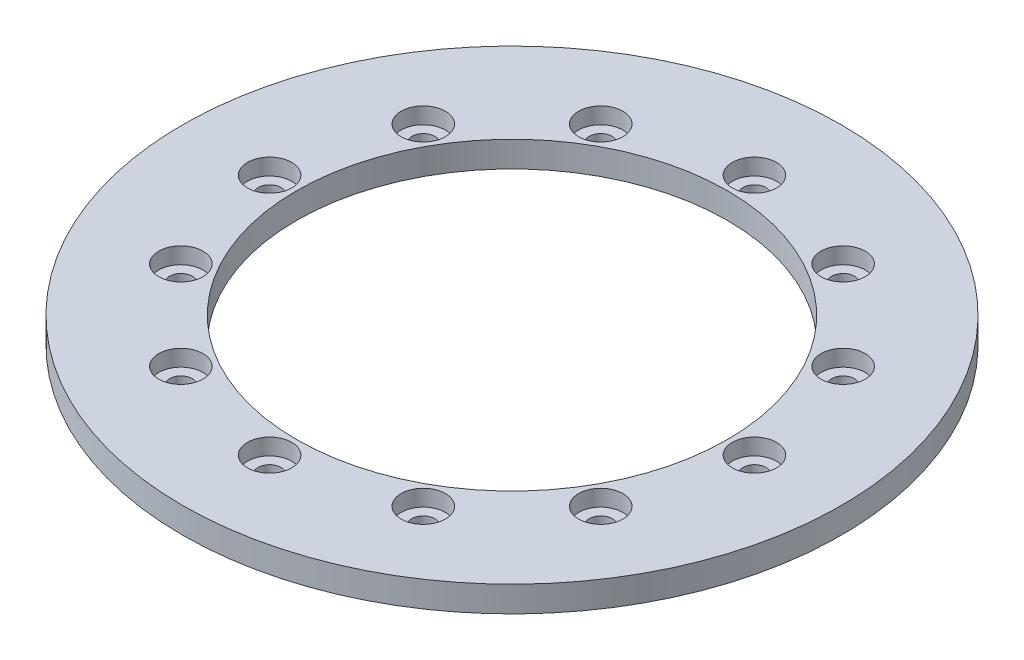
from build123d import *

# Parameters (mm, degrees)
SKETCH1_R                                      = 65
SKETCH1_R_2                                    = 42.5
BOSS_EXTRUDE1_DEPTH                            = 5.08
CBORE_FOR_8_BUTTON_HEAD_CAP_SCREW1_D           = 4.4958
CBORE_FOR_8_BUTTON_HEAD_CAP_SCREW1_CBORE_D     = 8.73252
CBORE_FOR_8_BUTTON_HEAD_CAP_SCREW1_CBORE_DEPTH = 3.2258
CIRPATTERN1_COUNT                              = 12


with BuildPart() as part:
    # Sketch1 → Boss-Extrude1 (new body)
    with BuildSketch(Plane(origin=(0, 0, 0), x_dir=(1, 0, 0), z_dir=(0, 1, 0))):
        with Locations(Location((0, 0, 0), (0, 0, 270))):
            Circle(SKETCH1_R)
        with Locations(Location((0, 0, 0), (0, 0, 270))):
            Circle(SKETCH1_R_2, mode=Mode.SUBTRACT)
    extrude(amount=BOSS_EXTRUDE1_DEPTH)

    # CBORE for _8 Button Head Cap Screw1 (through all)
    with Locations(Plane(origin=(0, 5.08, 0), x_dir=(1, 0, 0), z_dir=(0, 1, 0))):
        with Locations((47.81205, 0)):
            cbore_for_8_button_head_cap_screw1 = CounterBoreHole(CBORE_FOR_8_BUTTON_HEAD_CAP_SCREW1_D / 2, CBORE_FOR_8_BUTTON_HEAD_CAP_SCREW1_CBORE_D / 2, CBORE_FOR_8_BUTTON_HEAD_CAP_SCREW1_CBORE_DEPTH)

    # CirPattern1: CBORE for _8 Button Head Cap Screw1 ×12 about axis
    cirpattern1_axis = Axis((0, 0, 0), (0, 1, 0))
    for i in range(1, CIRPATTERN1_COUNT):
        add(cbore_for_8_button_head_cap_screw1.rotate(cirpattern1_axis, i * 360 / CIRPATTERN1_COUNT), mode=Mode.SUBTRACT)


solid = part.part
